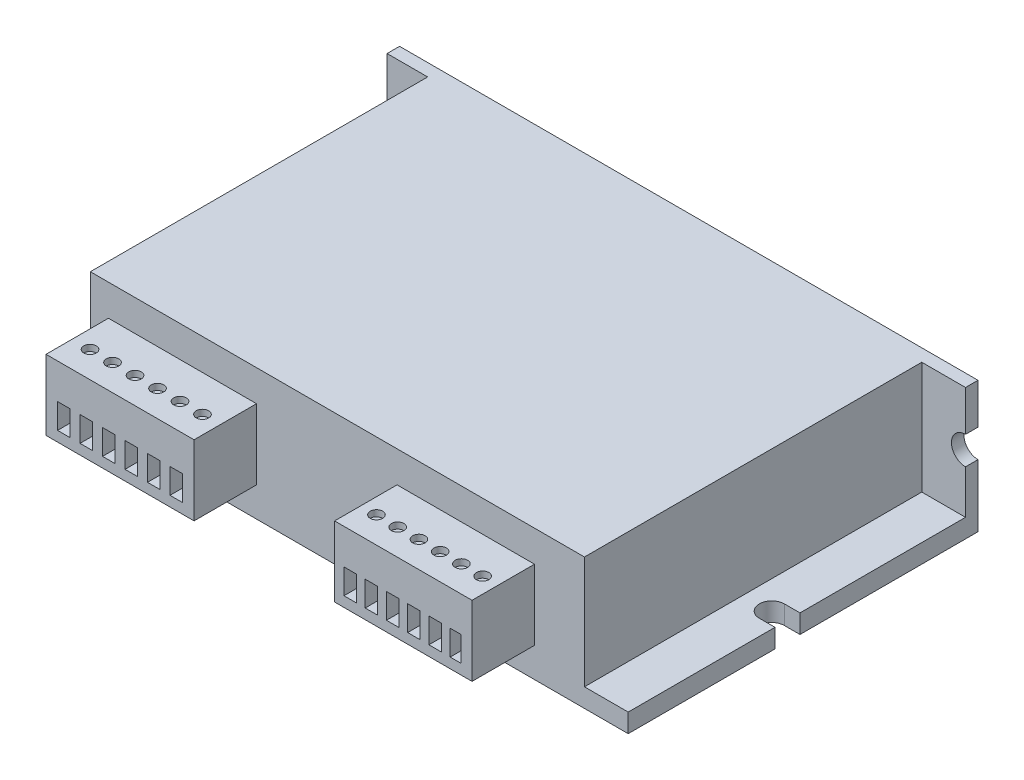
from build123d import *

# Parameters (mm, degrees)
SKETCH_1_W          = 92.6
SKETCH_1_H          = 56
EXTRUDE_1_DEPTH     = 3
SKETCH_2_W          = 92.6
SKETCH_2_H          = 2
EXTRUDE_2_DEPTH     = 18
SKETCH_3_W          = 79.1
SKETCH_3_H          = 54
EXTRUDE_3_DEPTH     = 18
CUT_EXTRUDE_1_DEPTH = 3
CUT_EXTRUDE_2_DEPTH = 2
SKETCH_6_W          = 23.7
SKETCH_6_H          = 11.25
SKETCH_6_W_2        = 22
EXTRUDE_4_DEPTH     = 10
SKETCH_7_R          = 1
CUT_EXTRUDE_3_DEPTH = 1
SKETCH_8_W          = 2
SKETCH_8_H          = 4
SKETCH_8_W_2        = 1.77
CUT_EXTRUDE_4_DEPTH = 3


with BuildPart() as part:
    # Sketch 1 → Extrude 1 (new body)
    with BuildSketch(Plane(origin=(0, 0, 0), x_dir=(1, 0, 0), z_dir=(0, 1, 0))):
        with Locations((46.3, 28)):
            Rectangle(SKETCH_1_W, SKETCH_1_H)
    extrude(amount=EXTRUDE_1_DEPTH)

    # Sketch 2 → Extrude 2 (add)
    with BuildSketch(Plane(origin=(0, 3, 0), x_dir=(1, 0, 0), z_dir=(0, 1, 0))):
        with Locations((46.3, 55)):
            Rectangle(SKETCH_2_W, SKETCH_2_H)
    extrude(amount=EXTRUDE_2_DEPTH)

    # Sketch 3 → Extrude 3 (add)
    with BuildSketch(Plane(origin=(0, 3, 0), x_dir=(1, 0, 0), z_dir=(0, 1, 0))):
        with Locations((46.05, 27)):
            Rectangle(SKETCH_3_W, SKETCH_3_H)
    extrude(amount=EXTRUDE_3_DEPTH)

    # Sketch 4 → Cut-Extrude 1 (cut)
    with BuildSketch(Plane(origin=(0, 3, 0), x_dir=(1, 0, 0), z_dir=(0, 1, 0))):
        with BuildLine():
            Line((0, 27.5), (2.5, 27.5))
            ThreePointArc((2.5, 27.5), (4.5, 25.5), (2.5, 23.5))
            Line((2.5, 23.5), (0, 23.5))
            Line((0, 23.5), (0, 27.5))
        make_face()
        with BuildLine():
            Line((92.6, 27.5), (90.1, 27.5))
            ThreePointArc((90.1, 27.5), (88.1, 25.5), (90.1, 23.5))
            Line((90.1, 23.5), (92.6, 23.5))
            Line((92.6, 23.5), (92.6, 27.5))
        make_face()
    extrude(amount=-CUT_EXTRUDE_1_DEPTH, mode=Mode.SUBTRACT)

    # Sketch 5 → Cut-Extrude 2 (cut)
    with BuildSketch(Plane(origin=(0, 0, -56), x_dir=(-1, 0, 0), z_dir=(0, 0, -1))):
        with BuildLine():
            Line((0, 14.5), (0, 10))
            ThreePointArc((0, 10), (-2.25, 12.25), (0, 14.5))
        make_face()
        with BuildLine():
            Line((-92.6, 14.5), (-92.6, 10))
            ThreePointArc((-92.6, 10), (-90.35, 12.25), (-92.6, 14.5))
        make_face()
    extrude(amount=-CUT_EXTRUDE_2_DEPTH, mode=Mode.SUBTRACT)

    # Sketch 6 → Extrude 4 (add)
    with BuildSketch(Plane.XY):
        with Locations((21.25, 10.375)):
            Rectangle(SKETCH_6_W, SKETCH_6_H)
        with Locations((66.6, 10.375)):
            Rectangle(SKETCH_6_W_2, SKETCH_6_H)
    extrude(amount=EXTRUDE_4_DEPTH)

    # Sketch 7 → Cut-Extrude 3 (cut)
    with BuildSketch(Plane(origin=(0, 16, 0), x_dir=(1, 0, 0), z_dir=(0, 1, 0))):
        with Locations(Location((12.25, -5.8, 0), (0, 0, 270))):
            Circle(SKETCH_7_R)
        with Locations(Location((15.85, -5.8, 0), (0, 0, 270))):
            Circle(SKETCH_7_R)
        with Locations(Location((19.45, -5.8, 0), (0, 0, 270))):
            Circle(SKETCH_7_R)
        with Locations(Location((23.05, -5.8, 0), (0, 0, 270))):
            Circle(SKETCH_7_R)
        with Locations(Location((26.65, -5.8, 0), (0, 0, 270))):
            Circle(SKETCH_7_R)
        with Locations(Location((30.25, -5.8, 0), (0, 0, 270))):
            Circle(SKETCH_7_R)
        with Locations(Location((58.1, -5.8, 0), (0, 0, 270))):
            Circle(SKETCH_7_R)
        with Locations(Location((61.5, -5.8, 0), (0, 0, 270))):
            Circle(SKETCH_7_R)
        with Locations(Location((64.9, -5.8, 0), (0, 0, 270))):
            Circle(SKETCH_7_R)
        with Locations(Location((68.3, -5.8, 0), (0, 0, 270))):
            Circle(SKETCH_7_R)
        with Locations(Location((71.7, -5.8, 0), (0, 0, 270))):
            Circle(SKETCH_7_R)
        with Locations(Location((75.1, -5.8, 0), (0, 0, 270))):
            Circle(SKETCH_7_R)
    extrude(amount=-CUT_EXTRUDE_3_DEPTH, mode=Mode.SUBTRACT)

    # Sketch 8 → Cut-Extrude 4 (cut)
    with BuildSketch(Plane.XY.offset(10)):
        with Locations((12.25, 8.375)):
            Rectangle(SKETCH_8_W, SKETCH_8_H)
        with Locations((15.85, 8.375)):
            Rectangle(SKETCH_8_W, SKETCH_8_H)
        with Locations((19.45, 8.375)):
            Rectangle(SKETCH_8_W, SKETCH_8_H)
        with Locations((23.05, 8.375)):
            Rectangle(SKETCH_8_W, SKETCH_8_H)
        with Locations((26.65, 8.375)):
            Rectangle(SKETCH_8_W, SKETCH_8_H)
        with Locations((30.25, 8.375)):
            Rectangle(SKETCH_8_W, SKETCH_8_H)
        with Locations((58.1, 8.375)):
            Rectangle(SKETCH_8_W, SKETCH_8_H)
        with Locations((61.5, 8.375)):
            Rectangle(SKETCH_8_W, SKETCH_8_H)
        with Locations((64.9, 8.375)):
            Rectangle(SKETCH_8_W, SKETCH_8_H)
        with Locations((68.3, 8.375)):
            Rectangle(SKETCH_8_W, SKETCH_8_H)
        with Locations((71.7, 8.375)):
            Rectangle(SKETCH_8_W, SKETCH_8_H)
        with Locations((74.985, 8.375)):
            Rectangle(SKETCH_8_W_2, SKETCH_8_H)
    extrude(amount=-CUT_EXTRUDE_4_DEPTH, mode=Mode.SUBTRACT)


solid = part.part
